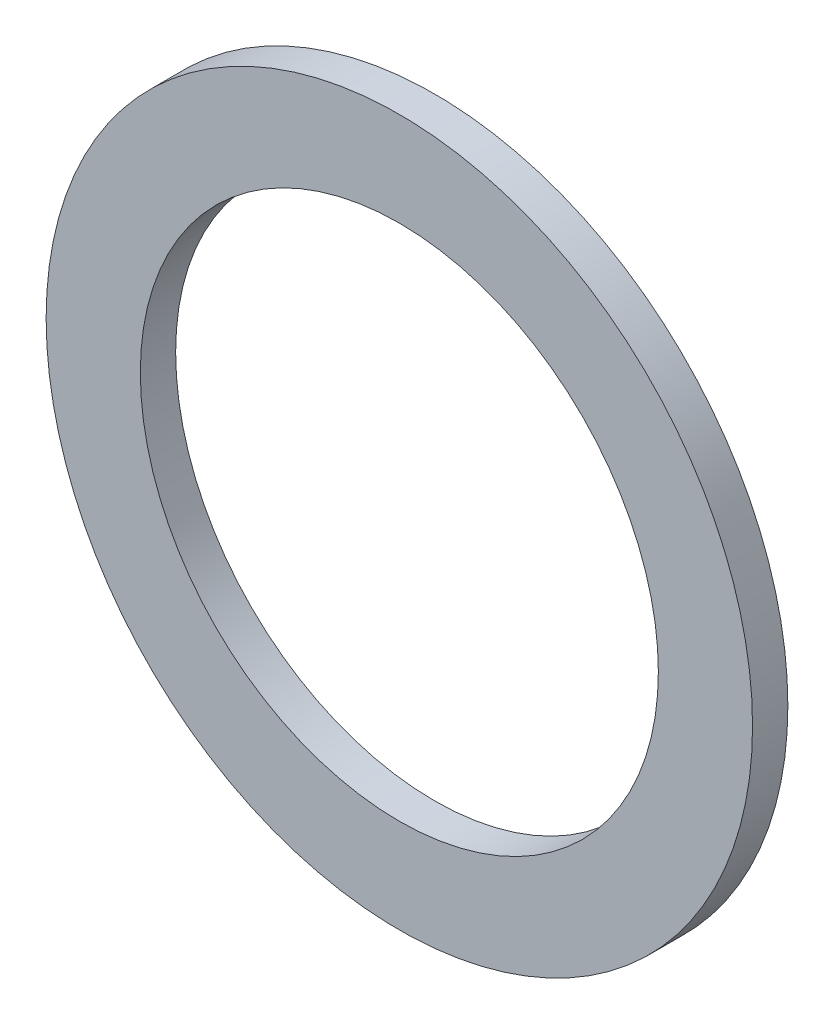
ISO-10303-21;
HEADER;
FILE_DESCRIPTION(('STEP AP214'),'2;1');
FILE_NAME('part.step','',(''),(''),'','','');
FILE_SCHEMA(('AUTOMOTIVE_DESIGN { 1 0 10303 214 1 1 1 1 }'));
ENDSEC;
DATA;
#1=APPLICATION_CONTEXT('core data for automotive mechanical design processes');
#2=APPLICATION_PROTOCOL_DEFINITION('international standard','automotive_design',2000,#1);
#3=PRODUCT_CONTEXT('',#1,'mechanical');
#4=PRODUCT('Part','Part','',(#3));
#5=PRODUCT_RELATED_PRODUCT_CATEGORY('part','',(#4));
#6=PRODUCT_DEFINITION_FORMATION('','',#4);
#7=PRODUCT_DEFINITION_CONTEXT('part definition',#1,'design');
#8=PRODUCT_DEFINITION('design','',#6,#7);
#9=PRODUCT_DEFINITION_SHAPE('','',#8);
#10=(LENGTH_UNIT() NAMED_UNIT(*) SI_UNIT(.MILLI.,.METRE.));
#11=(NAMED_UNIT(*) PLANE_ANGLE_UNIT() SI_UNIT($,.RADIAN.));
#12=(NAMED_UNIT(*) SI_UNIT($,.STERADIAN.) SOLID_ANGLE_UNIT());
#13=UNCERTAINTY_MEASURE_WITH_UNIT(LENGTH_MEASURE(1.E-05),#10,'distance_accuracy_value','');
#14=(GEOMETRIC_REPRESENTATION_CONTEXT(3) GLOBAL_UNCERTAINTY_ASSIGNED_CONTEXT((#13)) GLOBAL_UNIT_ASSIGNED_CONTEXT((#10,
#11,#12)) REPRESENTATION_CONTEXT('',''));
#15=CARTESIAN_POINT('',(0.,0.,0.));
#16=DIRECTION('',(0.,0.,1.));
#17=DIRECTION('',(1.,0.,0.));
#18=AXIS2_PLACEMENT_3D('',#15,#16,#17);
#19=CARTESIAN_POINT('',(0.,0.,3.));
#20=DIRECTION('',(0.,0.,1.));
#21=DIRECTION('',(1.,0.,0.));
#22=AXIS2_PLACEMENT_3D('',#19,#20,#21);
#23=PLANE('',#22);
#24=CARTESIAN_POINT('',(0.,0.,3.));
#25=DIRECTION('',(0.,0.,1.));
#26=DIRECTION('',(1.,0.,0.));
#27=AXIS2_PLACEMENT_3D('',#24,#25,#26);
#28=CIRCLE('',#27,30.);
#29=CARTESIAN_POINT('',(30.,0.,3.));
#30=VERTEX_POINT('',#29);
#31=EDGE_CURVE('E10',#30,#30,#28,.T.);
#32=ORIENTED_EDGE('',*,*,#31,.T.);
#33=EDGE_LOOP('',(#32));
#34=FACE_BOUND('',#33,.T.);
#35=CARTESIAN_POINT('',(0.,0.,3.));
#36=DIRECTION('',(0.,0.,1.));
#37=DIRECTION('',(1.,0.,0.));
#38=AXIS2_PLACEMENT_3D('',#35,#36,#37);
#39=CIRCLE('',#38,22.);
#40=CARTESIAN_POINT('',(22.,0.,3.));
#41=VERTEX_POINT('',#40);
#42=EDGE_CURVE('E33',#41,#41,#39,.T.);
#43=ORIENTED_EDGE('',*,*,#42,.F.);
#44=EDGE_LOOP('',(#43));
#45=FACE_BOUND('',#44,.T.);
#46=ADVANCED_FACE('F22',(#34,#45),#23,.T.);
#47=CARTESIAN_POINT('',(0.,0.,0.));
#48=DIRECTION('',(0.,0.,1.));
#49=DIRECTION('',(1.,0.,0.));
#50=AXIS2_PLACEMENT_3D('',#47,#48,#49);
#51=PLANE('',#50);
#52=CARTESIAN_POINT('',(0.,0.,0.));
#53=DIRECTION('',(0.,0.,1.));
#54=DIRECTION('',(1.,0.,0.));
#55=AXIS2_PLACEMENT_3D('',#52,#53,#54);
#56=CIRCLE('',#55,30.);
#57=CARTESIAN_POINT('',(30.,0.,0.));
#58=VERTEX_POINT('',#57);
#59=EDGE_CURVE('E29',#58,#58,#56,.T.);
#60=ORIENTED_EDGE('',*,*,#59,.F.);
#61=EDGE_LOOP('',(#60));
#62=FACE_BOUND('',#61,.T.);
#63=CARTESIAN_POINT('',(0.,0.,0.));
#64=DIRECTION('',(0.,0.,1.));
#65=DIRECTION('',(1.,0.,0.));
#66=AXIS2_PLACEMENT_3D('',#63,#64,#65);
#67=CIRCLE('',#66,22.);
#68=CARTESIAN_POINT('',(22.,0.,0.));
#69=VERTEX_POINT('',#68);
#70=EDGE_CURVE('E37',#69,#69,#67,.T.);
#71=ORIENTED_EDGE('',*,*,#70,.T.);
#72=EDGE_LOOP('',(#71));
#73=FACE_BOUND('',#72,.T.);
#74=ADVANCED_FACE('F43',(#62,#73),#51,.F.);
#75=CARTESIAN_POINT('',(0.,0.,3.));
#76=DIRECTION('',(0.,0.,-1.));
#77=DIRECTION('',(-1.,0.,0.));
#78=AXIS2_PLACEMENT_3D('',#75,#76,#77);
#79=CYLINDRICAL_SURFACE('',#78,30.);
#80=ORIENTED_EDGE('',*,*,#31,.F.);
#81=EDGE_LOOP('',(#80));
#82=FACE_BOUND('',#81,.T.);
#83=ORIENTED_EDGE('',*,*,#59,.T.);
#84=EDGE_LOOP('',(#83));
#85=FACE_BOUND('',#84,.T.);
#86=ADVANCED_FACE('F24',(#82,#85),#79,.T.);
#87=CARTESIAN_POINT('',(0.,0.,3.));
#88=DIRECTION('',(0.,0.,-1.));
#89=DIRECTION('',(-1.,0.,0.));
#90=AXIS2_PLACEMENT_3D('',#87,#88,#89);
#91=CYLINDRICAL_SURFACE('',#90,22.);
#92=ORIENTED_EDGE('',*,*,#42,.T.);
#93=EDGE_LOOP('',(#92));
#94=FACE_BOUND('',#93,.T.);
#95=ORIENTED_EDGE('',*,*,#70,.F.);
#96=EDGE_LOOP('',(#95));
#97=FACE_BOUND('',#96,.T.);
#98=ADVANCED_FACE('F45',(#94,#97),#91,.F.);
#99=CLOSED_SHELL('',(#46,#74,#86,#98));
#100=MANIFOLD_SOLID_BREP('B2',#99);
#101=ADVANCED_BREP_SHAPE_REPRESENTATION('',(#18,#100),#14);
#102=SHAPE_DEFINITION_REPRESENTATION(#9,#101);
ENDSEC;
END-ISO-10303-21;
